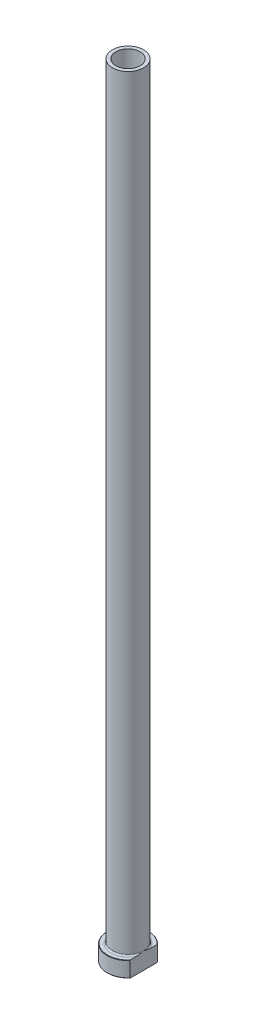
from build123d import *

# Parameters (mm, degrees)
FILLET1_R          = 0.8
CHAMFER1_SIZE      = 0.2
CUT_EXTRUDE1_DEPTH = 451.319886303
CHAMFER2_SIZE      = 0.5


with BuildPart() as part:
    # Sketch1 → Revolve1 (revolve)
    with BuildSketch(Plane.XY, mode=Mode.PRIVATE) as revolve1_sk:
        Polygon((-7, 450), (-9, 450), (-9, 9), (-12, 9), (-12, 0), (-7.25, 0), (-7.25, 383), (-7, 395), align=None)
    revolve(revolve1_sk.sketch.rotate(Axis((0, 92.187680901, 0), (0, -1, 0)), 270), axis=Axis((0, 92.187680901, 0), (0, -1, 0)))

    # Fillet1
    fillet1_edges = [part.edges().sort_by_distance(p)[0] for p in [
        (0, 9, -9),
    ]]
    fillet(fillet1_edges, radius=FILLET1_R)

    # Chamfer1
    chamfer1_edges = [part.edges().sort_by_distance(p)[0] for p in [
        (0, 0, -12),
        (0, 9, -12),
    ]]
    chamfer(chamfer1_edges, length=CHAMFER1_SIZE)

    # Sketch2 → Cut-Extrude1 (cut, through all)
    with BuildSketch(Plane.XZ):
        with BuildLine():
            Line((9, 7.937253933), (9, -7.937253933))
            ThreePointArc((9, -7.937253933), (12, 0), (9, 7.937253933))
        make_face()
    extrude(amount=-CUT_EXTRUDE1_DEPTH, mode=Mode.SUBTRACT)

    # Chamfer2
    chamfer2_edges = [part.edges().sort_by_distance(p)[0] for p in [
        (0, 0, -7.25),
    ]]
    chamfer(chamfer2_edges, length=CHAMFER2_SIZE)


solid = part.part
